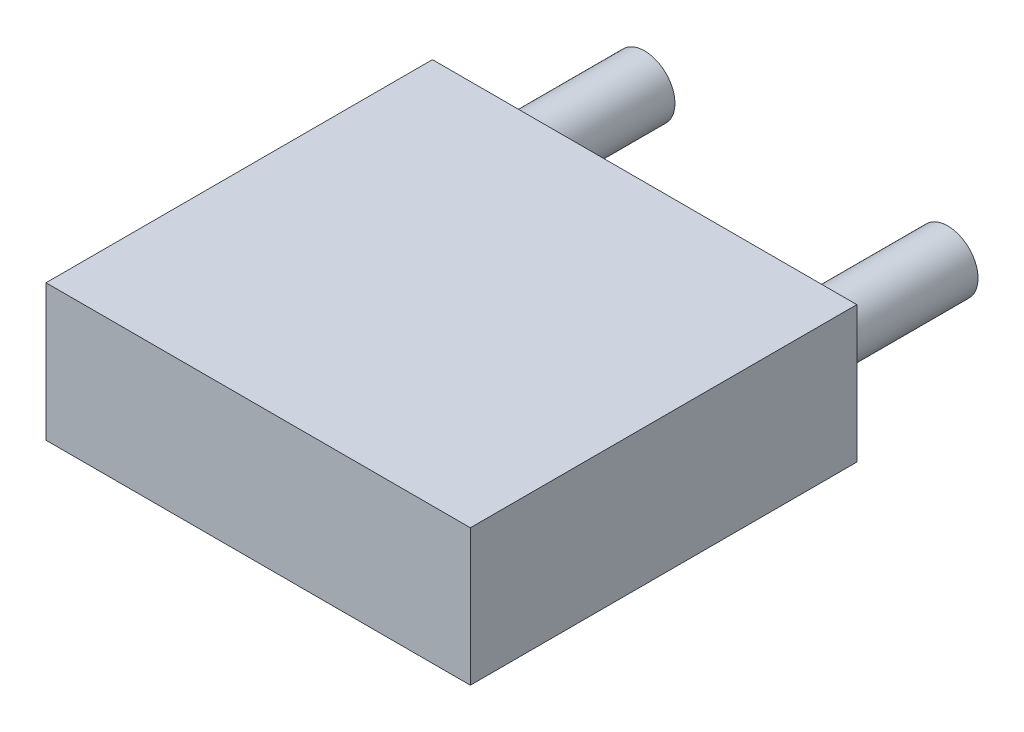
from build123d import *

# Parameters (mm, degrees)
SKETCH1_W             = 7.112
SKETCH1_H             = 2.286
BOSS_EXTRUDE1_DEPTH   = 6.477
SKETCH2_R             = 0.508
BOSS_EXTRUDE2_DEPTH   = 2.54
BOSS_EXTRUDE2_2_DEPTH = 2.54


with BuildPart() as part:
    # Sketch1 → Boss-Extrude1 (new body)
    with BuildSketch(Plane.XY):
        Rectangle(SKETCH1_W, SKETCH1_H)
    extrude(amount=BOSS_EXTRUDE1_DEPTH)


with BuildPart() as body_2:
    # Sketch2 → Boss-Extrude2 (new body)
    with BuildSketch(Plane(origin=(0, 0, 0), x_dir=(-1, 0, 0), z_dir=(0, 0, -1))):
        with Locations((2.54, 0)):
            Circle(SKETCH2_R)
    extrude(amount=BOSS_EXTRUDE2_DEPTH)


with BuildPart() as body_3:
    # Sketch2 → Boss-Extrude2 2 (new body)
    with BuildSketch(Plane(origin=(0, 0, 0), x_dir=(-1, 0, 0), z_dir=(0, 0, -1))):
        with Locations((-2.54, 0)):
            Circle(SKETCH2_R)
    extrude(amount=BOSS_EXTRUDE2_2_DEPTH)


solid = Compound([part.part, body_2.part, body_3.part])
